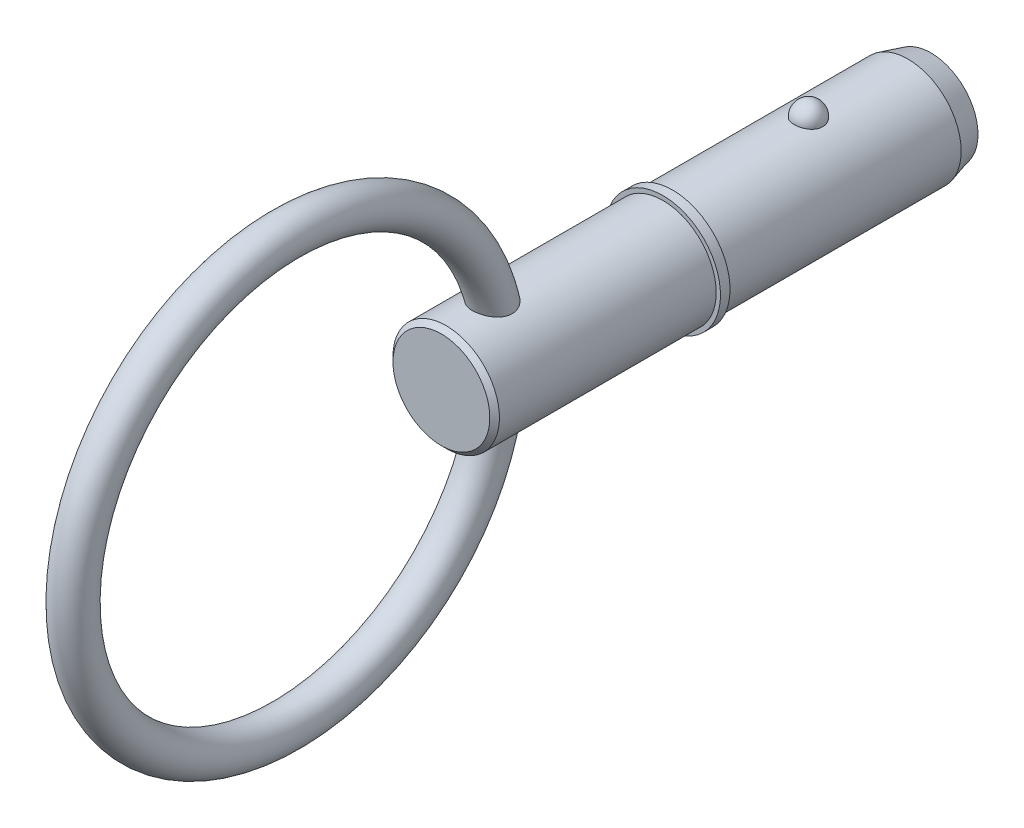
ISO-10303-21;
HEADER;
FILE_DESCRIPTION(('STEP AP214'),'2;1');
FILE_NAME('part.step','',(''),(''),'','','');
FILE_SCHEMA(('AUTOMOTIVE_DESIGN { 1 0 10303 214 1 1 1 1 }'));
ENDSEC;
DATA;
#1=APPLICATION_CONTEXT('core data for automotive mechanical design processes');
#2=APPLICATION_PROTOCOL_DEFINITION('international standard','automotive_design',2000,#1);
#3=PRODUCT_CONTEXT('',#1,'mechanical');
#4=PRODUCT('Part','Part','',(#3));
#5=PRODUCT_RELATED_PRODUCT_CATEGORY('part','',(#4));
#6=PRODUCT_DEFINITION_FORMATION('','',#4);
#7=PRODUCT_DEFINITION_CONTEXT('part definition',#1,'design');
#8=PRODUCT_DEFINITION('design','',#6,#7);
#9=PRODUCT_DEFINITION_SHAPE('','',#8);
#10=(LENGTH_UNIT() NAMED_UNIT(*) SI_UNIT(.MILLI.,.METRE.));
#11=(NAMED_UNIT(*) PLANE_ANGLE_UNIT() SI_UNIT($,.RADIAN.));
#12=(NAMED_UNIT(*) SI_UNIT($,.STERADIAN.) SOLID_ANGLE_UNIT());
#13=UNCERTAINTY_MEASURE_WITH_UNIT(LENGTH_MEASURE(1.E-05),#10,'distance_accuracy_value','');
#14=(GEOMETRIC_REPRESENTATION_CONTEXT(3) GLOBAL_UNCERTAINTY_ASSIGNED_CONTEXT((#13)) GLOBAL_UNIT_ASSIGNED_CONTEXT((#10,
#11,#12)) REPRESENTATION_CONTEXT('',''));
#15=CARTESIAN_POINT('',(0.,0.,0.));
#16=DIRECTION('',(0.,0.,1.));
#17=DIRECTION('',(1.,0.,0.));
#18=AXIS2_PLACEMENT_3D('',#15,#16,#17);
#19=CARTESIAN_POINT('',(0.,0.,12.7));
#20=DIRECTION('',(0.,0.,-1.));
#21=DIRECTION('',(-1.,0.,0.));
#22=AXIS2_PLACEMENT_3D('',#19,#20,#21);
#23=CYLINDRICAL_SURFACE('',#22,5.555);
#24=CARTESIAN_POINT('',(1.47653932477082,5.35517101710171,-1.49));
#25=CARTESIAN_POINT('',(1.47653767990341,5.35517235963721,-1.40667872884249));
#26=CARTESIAN_POINT('',(1.4697233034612,5.35706459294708,-1.32333626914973));
#27=CARTESIAN_POINT('',(1.4426291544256,5.36442332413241,-1.15900769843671));
#28=CARTESIAN_POINT('',(1.42234344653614,5.36989139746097,-1.07802264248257));
#29=CARTESIAN_POINT('',(1.36882802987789,5.38378061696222,-0.920757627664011));
#30=CARTESIAN_POINT('',(1.33560404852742,5.39220045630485,-0.844475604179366));
#31=CARTESIAN_POINT('',(1.25704906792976,5.41105136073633,-0.698703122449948));
#32=CARTESIAN_POINT('',(1.21171855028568,5.42148234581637,-0.629212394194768));
#33=CARTESIAN_POINT('',(1.10986325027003,5.44324765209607,-0.498626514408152));
#34=CARTESIAN_POINT('',(1.05328868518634,5.45458585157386,-0.437570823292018));
#35=CARTESIAN_POINT('',(0.930545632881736,5.4768596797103,-0.325918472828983));
#36=CARTESIAN_POINT('',(0.864377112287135,5.48779530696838,-0.275321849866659));
#37=CARTESIAN_POINT('',(0.724412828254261,5.50801510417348,-0.186125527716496));
#38=CARTESIAN_POINT('',(0.650637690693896,5.51730356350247,-0.147494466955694));
#39=CARTESIAN_POINT('',(0.497383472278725,5.53322345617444,-0.0831582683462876));
#40=CARTESIAN_POINT('',(0.417904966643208,5.53985515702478,-0.0574518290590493));
#41=CARTESIAN_POINT('',(0.256903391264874,5.54963245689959,-0.0200294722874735));
#42=CARTESIAN_POINT('',(0.17543580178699,5.55283384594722,-0.00808940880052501));
#43=CARTESIAN_POINT('',(0.0115885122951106,5.55559187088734,0.00221439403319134));
#44=CARTESIAN_POINT('',(-0.0707911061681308,5.55514883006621,0.000579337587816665));
#45=CARTESIAN_POINT('',(-0.232980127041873,5.55069756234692,-0.0161051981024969));
#46=CARTESIAN_POINT('',(-0.312809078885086,5.54673626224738,-0.0309781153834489));
#47=CARTESIAN_POINT('',(-0.468771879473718,5.5357377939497,-0.073474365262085));
#48=CARTESIAN_POINT('',(-0.544905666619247,5.52870057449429,-0.101097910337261));
#49=CARTESIAN_POINT('',(-0.691800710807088,5.51225307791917,-0.168516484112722));
#50=CARTESIAN_POINT('',(-0.762530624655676,5.50283015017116,-0.208376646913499));
#51=CARTESIAN_POINT('',(-0.896294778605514,5.48263289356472,-0.299136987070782));
#52=CARTESIAN_POINT('',(-0.959328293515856,5.47185843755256,-0.350038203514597));
#53=CARTESIAN_POINT('',(-1.07712789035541,5.44990641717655,-0.462517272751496));
#54=CARTESIAN_POINT('',(-1.13172901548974,5.43872509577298,-0.524267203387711));
#55=CARTESIAN_POINT('',(-1.2299173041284,5.41736658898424,-0.656133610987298));
#56=CARTESIAN_POINT('',(-1.2735037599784,5.40718946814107,-0.726250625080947));
#57=CARTESIAN_POINT('',(-1.34896420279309,5.38886361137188,-0.873713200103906));
#58=CARTESIAN_POINT('',(-1.38071142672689,5.38073711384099,-0.951126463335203));
#59=CARTESIAN_POINT('',(-1.4310375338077,5.36757288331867,-1.11037033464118));
#60=CARTESIAN_POINT('',(-1.44961676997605,5.3625350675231,-1.19220082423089));
#61=CARTESIAN_POINT('',(-1.47308754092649,5.35613553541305,-1.35761209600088));
#62=CARTESIAN_POINT('',(-1.47803294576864,5.35475935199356,-1.44118467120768));
#63=CARTESIAN_POINT('',(-1.47426441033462,5.35579807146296,-1.6079958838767));
#64=CARTESIAN_POINT('',(-1.46555080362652,5.35821288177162,-1.69123452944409));
#65=CARTESIAN_POINT('',(-1.43475662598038,5.36653964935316,-1.8546288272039));
#66=CARTESIAN_POINT('',(-1.41273621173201,5.37243586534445,-1.93479663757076));
#67=CARTESIAN_POINT('',(-1.35593151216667,5.38705199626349,-2.0902011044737));
#68=CARTESIAN_POINT('',(-1.32114675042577,5.39577201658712,-2.16543757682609));
#69=CARTESIAN_POINT('',(-1.23947506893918,5.41511674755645,-2.30926926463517));
#70=CARTESIAN_POINT('',(-1.1925277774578,5.42575087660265,-2.37782893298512));
#71=CARTESIAN_POINT('',(-1.08780725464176,5.44771095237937,-2.50598876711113));
#72=CARTESIAN_POINT('',(-1.03003365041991,5.45903692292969,-2.56558862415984));
#73=CARTESIAN_POINT('',(-0.904953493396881,5.48116073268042,-2.67436535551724));
#74=CARTESIAN_POINT('',(-0.837616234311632,5.49195671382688,-2.7235073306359));
#75=CARTESIAN_POINT('',(-0.695379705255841,5.51177099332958,-2.8097317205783));
#76=CARTESIAN_POINT('',(-0.620480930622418,5.52078940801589,-2.84681492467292));
#77=CARTESIAN_POINT('',(-0.466144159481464,5.53594369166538,-2.90749751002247));
#78=CARTESIAN_POINT('',(-0.386768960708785,5.54211181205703,-2.93124844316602));
#79=CARTESIAN_POINT('',(-0.224991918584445,5.5510324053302,-2.96523308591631));
#80=CARTESIAN_POINT('',(-0.142590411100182,5.55378525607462,-2.97546829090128));
#81=CARTESIAN_POINT('',(0.0213711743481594,5.55555351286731,-2.98206550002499));
#82=CARTESIAN_POINT('',(0.102921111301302,5.55463281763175,-2.97866468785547));
#83=CARTESIAN_POINT('',(0.2642564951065,5.54929804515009,-2.95862186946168));
#84=CARTESIAN_POINT('',(0.344041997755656,5.54488407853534,-2.94198028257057));
#85=CARTESIAN_POINT('',(0.499344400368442,5.53305794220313,-2.89600357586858));
#86=CARTESIAN_POINT('',(0.574874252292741,5.52565550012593,-2.86670961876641));
#87=CARTESIAN_POINT('',(0.71989857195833,5.50863937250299,-2.79624249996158));
#88=CARTESIAN_POINT('',(0.789392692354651,5.49902555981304,-2.75506865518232));
#89=CARTESIAN_POINT('',(0.921480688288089,5.47845199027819,-2.66127110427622));
#90=CARTESIAN_POINT('',(0.983960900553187,5.46747485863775,-2.60849118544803));
#91=CARTESIAN_POINT('',(1.09925057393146,5.44546837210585,-2.49325304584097));
#92=CARTESIAN_POINT('',(1.15205830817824,5.43443900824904,-2.43079310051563));
#93=CARTESIAN_POINT('',(1.24742943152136,5.41335152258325,-2.29680711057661));
#94=CARTESIAN_POINT('',(1.28981661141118,5.40331162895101,-2.22515272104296));
#95=CARTESIAN_POINT('',(1.36214937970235,5.38553336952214,-2.07558035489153));
#96=CARTESIAN_POINT('',(1.39210034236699,5.37779400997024,-1.99766510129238));
#97=CARTESIAN_POINT('',(1.43569518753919,5.36630594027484,-1.84848338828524));
#98=CARTESIAN_POINT('',(1.45098536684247,5.36216169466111,-1.77772322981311));
#99=CARTESIAN_POINT('',(1.47140805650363,5.35659367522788,-1.63464735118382));
#100=CARTESIAN_POINT('',(1.47654075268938,5.35516985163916,-1.56233165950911));
#101=CARTESIAN_POINT('',(1.47653932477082,5.35517101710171,-1.49));
#102=B_SPLINE_CURVE_WITH_KNOTS('',3,(#24,#25,#26,#27,#28,#29,#30,#31,#32,#33,#34,#35,#36,#37,
#38,#39,#40,#41,#42,#43,#44,#45,#46,#47,#48,#49,#50,#51,#52,#53,#54,#55,#56,#57,#58,#59,#60,#61,
#62,#63,#64,#65,#66,#67,#68,#69,#70,#71,#72,#73,#74,#75,#76,#77,#78,#79,#80,#81,#82,#83,#84,#85,
#86,#87,#88,#89,#90,#91,#92,#93,#94,#95,#96,#97,#98,#99,#100,#101),.UNSPECIFIED.,.T.,.F.,(4,2,2,
2,2,2,2,2,2,2,2,2,2,2,2,2,2,2,2,2,2,2,2,2,2,2,2,2,2,2,2,2,2,2,2,2,2,2,4),(0.,0.249703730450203,
0.4995175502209,0.749220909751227,0.998914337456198,1.24973894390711,1.50056442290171,
1.75072681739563,2.00086401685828,2.24686822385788,2.49285060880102,2.73560052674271,
2.97835449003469,3.22242369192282,3.46651587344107,3.71490232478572,3.96330473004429,
4.21429522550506,4.46527899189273,4.71526963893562,4.9652541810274,5.21411697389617,
5.46298905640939,5.71312097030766,5.96326150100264,6.21422412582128,6.46517032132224,
6.71320296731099,6.96120816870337,7.20491846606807,7.44862104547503,7.69153667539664,
7.93446627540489,8.18089104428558,8.42735976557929,8.67774679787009,8.92802551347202,
9.14479867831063,9.36156787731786),.UNSPECIFIED.);
#103=CARTESIAN_POINT('',(1.47653932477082,5.35517101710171,-1.49));
#104=VERTEX_POINT('',#103);
#105=EDGE_CURVE('E103',#104,#104,#102,.T.);
#106=ORIENTED_EDGE('',*,*,#105,.T.);
#107=EDGE_LOOP('',(#106));
#108=FACE_BOUND('',#107,.T.);
#109=CARTESIAN_POINT('',(0.,0.,-11.87));
#110=DIRECTION('',(0.,0.,-1.));
#111=DIRECTION('',(-1.,0.,0.));
#112=AXIS2_PLACEMENT_3D('',#109,#110,#111);
#113=CIRCLE('',#112,5.555);
#114=CARTESIAN_POINT('',(5.555,0.,-11.87));
#115=VERTEX_POINT('',#114);
#116=EDGE_CURVE('E111',#115,#115,#113,.F.);
#117=ORIENTED_EDGE('',*,*,#116,.T.);
#118=EDGE_LOOP('',(#117));
#119=FACE_BOUND('',#118,.T.);
#120=CARTESIAN_POINT('',(0.,0.,12.7));
#121=DIRECTION('',(0.,0.,1.));
#122=DIRECTION('',(1.,0.,0.));
#123=AXIS2_PLACEMENT_3D('',#120,#121,#122);
#124=CIRCLE('',#123,5.555);
#125=CARTESIAN_POINT('',(5.555,0.,12.7));
#126=VERTEX_POINT('',#125);
#127=EDGE_CURVE('E109',#126,#126,#124,.T.);
#128=ORIENTED_EDGE('',*,*,#127,.F.);
#129=EDGE_LOOP('',(#128));
#130=FACE_BOUND('',#129,.T.);
#131=ADVANCED_FACE('F39',(#108,#119,#130),#23,.T.);
#132=CARTESIAN_POINT('',(0.,0.,-14.27));
#133=DIRECTION('',(0.,0.,-1.));
#134=DIRECTION('',(-1.,0.,0.));
#135=AXIS2_PLACEMENT_3D('',#132,#133,#134);
#136=PLANE('',#135);
#137=CARTESIAN_POINT('',(0.,0.,-14.27));
#138=DIRECTION('',(0.,0.,-1.));
#139=DIRECTION('',(-1.,0.,0.));
#140=AXIS2_PLACEMENT_3D('',#137,#138,#139);
#141=CIRCLE('',#140,4.9119219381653);
#142=CARTESIAN_POINT('',(4.9119219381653,0.,-14.27));
#143=VERTEX_POINT('',#142);
#144=EDGE_CURVE('E143',#143,#143,#141,.T.);
#145=ORIENTED_EDGE('',*,*,#144,.T.);
#146=EDGE_LOOP('',(#145));
#147=FACE_BOUND('',#146,.T.);
#148=ADVANCED_FACE('F89',(#147),#136,.T.);
#149=CARTESIAN_POINT('',(0.,0.,-14.27));
#150=DIRECTION('',(0.,0.,1.));
#151=DIRECTION('',(1.,0.,0.));
#152=AXIS2_PLACEMENT_3D('',#149,#150,#151);
#153=CONICAL_SURFACE('',#152,4.9119219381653,0.261799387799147);
#154=CARTESIAN_POINT('',(5.555,0.,-11.87));
#155=CARTESIAN_POINT('',(5.54830127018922,0.,-11.895));
#156=CARTESIAN_POINT('',(5.54160254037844,0.,-11.92));
#157=CARTESIAN_POINT('',(5.52820508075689,0.,-11.97));
#158=CARTESIAN_POINT('',(5.52150635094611,0.,-11.995));
#159=CARTESIAN_POINT('',(5.50810889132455,0.,-12.045));
#160=CARTESIAN_POINT('',(5.50141016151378,0.,-12.07));
#161=CARTESIAN_POINT('',(5.48801270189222,0.,-12.12));
#162=CARTESIAN_POINT('',(5.48131397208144,0.,-12.145));
#163=CARTESIAN_POINT('',(5.46791651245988,0.,-12.195));
#164=CARTESIAN_POINT('',(5.46121778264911,0.,-12.22));
#165=CARTESIAN_POINT('',(5.44782032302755,0.,-12.27));
#166=CARTESIAN_POINT('',(5.44112159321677,0.,-12.295));
#167=CARTESIAN_POINT('',(5.42772413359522,0.,-12.345));
#168=CARTESIAN_POINT('',(5.42102540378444,0.,-12.37));
#169=CARTESIAN_POINT('',(5.40762794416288,0.,-12.42));
#170=CARTESIAN_POINT('',(5.4009292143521,0.,-12.445));
#171=CARTESIAN_POINT('',(5.38753175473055,0.,-12.495));
#172=CARTESIAN_POINT('',(5.38083302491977,0.,-12.52));
#173=CARTESIAN_POINT('',(5.36743556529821,0.,-12.57));
#174=CARTESIAN_POINT('',(5.36073683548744,0.,-12.595));
#175=CARTESIAN_POINT('',(5.34733937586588,0.,-12.645));
#176=CARTESIAN_POINT('',(5.3406406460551,0.,-12.67));
#177=CARTESIAN_POINT('',(5.32724318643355,0.,-12.72));
#178=CARTESIAN_POINT('',(5.32054445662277,0.,-12.745));
#179=CARTESIAN_POINT('',(5.30714699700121,0.,-12.795));
#180=CARTESIAN_POINT('',(5.30044826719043,0.,-12.82));
#181=CARTESIAN_POINT('',(5.28705080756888,0.,-12.87));
#182=CARTESIAN_POINT('',(5.2803520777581,0.,-12.895));
#183=CARTESIAN_POINT('',(5.26695461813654,0.,-12.945));
#184=CARTESIAN_POINT('',(5.26025588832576,0.,-12.97));
#185=CARTESIAN_POINT('',(5.24685842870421,0.,-13.02));
#186=CARTESIAN_POINT('',(5.24015969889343,0.,-13.045));
#187=CARTESIAN_POINT('',(5.22676223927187,0.,-13.095));
#188=CARTESIAN_POINT('',(5.2200635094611,0.,-13.12));
#189=CARTESIAN_POINT('',(5.20666604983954,0.,-13.17));
#190=CARTESIAN_POINT('',(5.19996732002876,0.,-13.195));
#191=CARTESIAN_POINT('',(5.1865698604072,0.,-13.245));
#192=CARTESIAN_POINT('',(5.17987113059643,0.,-13.27));
#193=CARTESIAN_POINT('',(5.16647367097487,0.,-13.32));
#194=CARTESIAN_POINT('',(5.15977494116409,0.,-13.345));
#195=CARTESIAN_POINT('',(5.14637748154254,0.,-13.395));
#196=CARTESIAN_POINT('',(5.13967875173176,0.,-13.42));
#197=CARTESIAN_POINT('',(5.1262812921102,0.,-13.47));
#198=CARTESIAN_POINT('',(5.11958256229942,0.,-13.495));
#199=CARTESIAN_POINT('',(5.10618510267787,0.,-13.545));
#200=CARTESIAN_POINT('',(5.09948637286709,0.,-13.57));
#201=CARTESIAN_POINT('',(5.08608891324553,0.,-13.62));
#202=CARTESIAN_POINT('',(5.07939018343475,0.,-13.645));
#203=CARTESIAN_POINT('',(5.0659927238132,0.,-13.695));
#204=CARTESIAN_POINT('',(5.05929399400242,0.,-13.72));
#205=CARTESIAN_POINT('',(5.04589653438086,0.,-13.77));
#206=CARTESIAN_POINT('',(5.03919780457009,0.,-13.795));
#207=CARTESIAN_POINT('',(5.02580034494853,0.,-13.845));
#208=CARTESIAN_POINT('',(5.01910161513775,0.,-13.87));
#209=CARTESIAN_POINT('',(5.0057041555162,0.,-13.92));
#210=CARTESIAN_POINT('',(4.99900542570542,0.,-13.945));
#211=CARTESIAN_POINT('',(4.98560796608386,0.,-13.995));
#212=CARTESIAN_POINT('',(4.97890923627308,0.,-14.02));
#213=CARTESIAN_POINT('',(4.96551177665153,0.,-14.07));
#214=CARTESIAN_POINT('',(4.95881304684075,0.,-14.095));
#215=CARTESIAN_POINT('',(4.94541558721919,0.,-14.145));
#216=CARTESIAN_POINT('',(4.93871685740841,0.,-14.17));
#217=CARTESIAN_POINT('',(4.92531939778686,0.,-14.22));
#218=CARTESIAN_POINT('',(4.91862066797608,0.,-14.245));
#219=CARTESIAN_POINT('',(4.9119219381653,0.,-14.27));
#220=B_SPLINE_CURVE_WITH_KNOTS('',3,(#154,#155,#156,#157,#158,#159,#160,#161,#162,#163,#164,
#165,#166,#167,#168,#169,#170,#171,#172,#173,#174,#175,#176,#177,#178,#179,#180,#181,#182,#183,
#184,#185,#186,#187,#188,#189,#190,#191,#192,#193,#194,#195,#196,#197,#198,#199,#200,#201,#202,
#203,#204,#205,#206,#207,#208,#209,#210,#211,#212,#213,#214,#215,#216,#217,#218,#219),
.UNSPECIFIED.,.F.,.F.,(4,2,2,2,2,2,2,2,2,2,2,2,2,2,2,2,2,2,2,2,2,2,2,2,2,2,2,2,2,2,2,2,4),(0.,
0.0776457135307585,0.155291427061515,0.232937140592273,0.31058285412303,0.388228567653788,
0.465874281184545,0.543519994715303,0.62116570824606,0.698811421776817,0.776457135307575,
0.854102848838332,0.93174856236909,1.00939427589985,1.08703998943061,1.16468570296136,
1.24233141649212,1.31997713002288,1.39762284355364,1.47526855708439,1.55291427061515,
1.63055998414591,1.70820569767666,1.78585141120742,1.86349712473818,1.94114283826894,
2.0187885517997,2.09643426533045,2.17407997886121,2.25172569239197,2.32937140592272,
2.40701711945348,2.48466283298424),.UNSPECIFIED.);
#221=EDGE_CURVE('BSEAM95',#115,#143,#220,.T.);
#222=ORIENTED_EDGE('',*,*,#116,.F.);
#223=ORIENTED_EDGE('',*,*,#144,.F.);
#224=ORIENTED_EDGE('',*,*,#221,.T.);
#225=ORIENTED_EDGE('',*,*,#221,.F.);
#226=EDGE_LOOP('',(#222,#224,#223,#225));
#227=FACE_BOUND('',#226,.T.);
#228=ADVANCED_FACE('F95',(#227),#153,.T.);
#229=CARTESIAN_POINT('',(0.,5.555,-1.49));
#230=DIRECTION('',(0.,1.,0.));
#231=DIRECTION('',(0.,0.,-1.));
#232=AXIS2_PLACEMENT_3D('',#229,#230,#231);
#233=SPHERICAL_SURFACE('',#232,1.49);
#234=ORIENTED_EDGE('',*,*,#105,.F.);
#235=EDGE_LOOP('',(#234));
#236=FACE_BOUND('',#235,.T.);
#237=ADVANCED_FACE('F114',(#236),#233,.T.);
#238=CARTESIAN_POINT('',(0.,0.,12.7));
#239=DIRECTION('',(0.,0.,-1.));
#240=DIRECTION('',(-1.,0.,0.));
#241=AXIS2_PLACEMENT_3D('',#238,#239,#240);
#242=PLANE('',#241);
#243=ORIENTED_EDGE('',*,*,#127,.T.);
#244=EDGE_LOOP('',(#243));
#245=FACE_BOUND('',#244,.T.);
#246=CARTESIAN_POINT('',(0.,0.,12.7));
#247=DIRECTION('',(0.,0.,-1.));
#248=DIRECTION('',(-1.,0.,0.));
#249=AXIS2_PLACEMENT_3D('',#246,#247,#248);
#250=CIRCLE('',#249,6.);
#251=CARTESIAN_POINT('',(-6.,0.,12.7));
#252=VERTEX_POINT('',#251);
#253=EDGE_CURVE('E110',#252,#252,#250,.T.);
#254=ORIENTED_EDGE('',*,*,#253,.T.);
#255=EDGE_LOOP('',(#254));
#256=FACE_BOUND('',#255,.T.);
#257=ADVANCED_FACE('F118',(#245,#256),#242,.T.);
#258=CARTESIAN_POINT('',(0.,0.,33.7287874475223));
#259=DIRECTION('',(0.,0.,-1.));
#260=DIRECTION('',(-1.,0.,0.));
#261=AXIS2_PLACEMENT_3D('',#258,#259,#260);
#262=CYLINDRICAL_SURFACE('',#261,6.);
#263=CARTESIAN_POINT('',(0.,0.,13.7));
#264=DIRECTION('',(0.,0.,-1.));
#265=DIRECTION('',(-1.,0.,0.));
#266=AXIS2_PLACEMENT_3D('',#263,#264,#265);
#267=CIRCLE('',#266,6.);
#268=CARTESIAN_POINT('',(-6.,0.,13.7));
#269=VERTEX_POINT('',#268);
#270=EDGE_CURVE('E135',#269,#269,#267,.T.);
#271=ORIENTED_EDGE('',*,*,#270,.T.);
#272=EDGE_LOOP('',(#271));
#273=FACE_BOUND('',#272,.T.);
#274=ORIENTED_EDGE('',*,*,#253,.F.);
#275=EDGE_LOOP('',(#274));
#276=FACE_BOUND('',#275,.T.);
#277=ADVANCED_FACE('F122',(#273,#276),#262,.T.);
#278=CARTESIAN_POINT('',(0.,6.,13.7));
#279=DIRECTION('',(0.,0.,1.));
#280=DIRECTION('',(1.,0.,0.));
#281=AXIS2_PLACEMENT_3D('',#278,#279,#280);
#282=PLANE('',#281);
#283=CARTESIAN_POINT('',(0.,0.,13.7));
#284=DIRECTION('',(0.,0.,1.));
#285=DIRECTION('',(1.,0.,0.));
#286=AXIS2_PLACEMENT_3D('',#283,#284,#285);
#287=CIRCLE('',#286,5.555);
#288=CARTESIAN_POINT('',(5.555,0.,13.7));
#289=VERTEX_POINT('',#288);
#290=EDGE_CURVE('E113',#289,#289,#287,.T.);
#291=ORIENTED_EDGE('',*,*,#290,.F.);
#292=EDGE_LOOP('',(#291));
#293=FACE_BOUND('',#292,.T.);
#294=ORIENTED_EDGE('',*,*,#270,.F.);
#295=EDGE_LOOP('',(#294));
#296=FACE_BOUND('',#295,.T.);
#297=ADVANCED_FACE('F86',(#293,#296),#282,.T.);
#298=CARTESIAN_POINT('',(0.,0.,36.83));
#299=DIRECTION('',(0.,0.,-1.));
#300=DIRECTION('',(-1.,0.,0.));
#301=AXIS2_PLACEMENT_3D('',#298,#299,#300);
#302=CYLINDRICAL_SURFACE('',#301,5.555);
#303=CARTESIAN_POINT('',(-1.10556570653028,-5.44387265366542,29.7918269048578));
#304=CARTESIAN_POINT('',(-1.01228489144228,-5.46281185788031,29.7327206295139));
#305=CARTESIAN_POINT('',(-0.913680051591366,-5.48032092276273,29.6812596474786));
#306=CARTESIAN_POINT('',(-0.708593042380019,-5.51059942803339,29.5948655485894));
#307=CARTESIAN_POINT('',(-0.602092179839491,-5.52335716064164,29.5599732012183));
#308=CARTESIAN_POINT('',(-0.384392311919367,-5.54275997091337,29.5076350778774));
#309=CARTESIAN_POINT('',(-0.273196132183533,-5.54940867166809,29.4901789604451));
#310=CARTESIAN_POINT('',(-0.0493180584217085,-5.55590918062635,29.4731070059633));
#311=CARTESIAN_POINT('',(0.063362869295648,-5.55576521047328,29.4734800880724));
#312=CARTESIAN_POINT('',(0.286346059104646,-5.54872955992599,29.4919679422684));
#313=CARTESIAN_POINT('',(0.396658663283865,-5.54187921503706,29.5099740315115));
#314=CARTESIAN_POINT('',(0.612520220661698,-5.52219137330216,29.56315855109));
#315=CARTESIAN_POINT('',(0.718068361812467,-5.50935286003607,29.5983398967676));
#316=CARTESIAN_POINT('',(0.921837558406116,-5.47895041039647,29.6852597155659));
#317=CARTESIAN_POINT('',(1.02003071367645,-5.46136954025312,29.7370576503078));
#318=CARTESIAN_POINT('',(1.20597835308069,-5.42334376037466,29.8560715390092));
#319=CARTESIAN_POINT('',(1.29373197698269,-5.40289861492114,29.923288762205));
#320=CARTESIAN_POINT('',(1.4567614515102,-5.36124957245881,30.0720711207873));
#321=CARTESIAN_POINT('',(1.53197150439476,-5.34004234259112,30.1537075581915));
#322=CARTESIAN_POINT('',(1.66713264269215,-5.29940466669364,30.3291453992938));
#323=CARTESIAN_POINT('',(1.72708783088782,-5.27997374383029,30.4229435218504));
#324=CARTESIAN_POINT('',(1.82862428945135,-5.24566221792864,30.6176424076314));
#325=CARTESIAN_POINT('',(1.87063678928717,-5.23067782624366,30.718299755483));
#326=CARTESIAN_POINT('',(1.93737592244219,-5.20633032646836,30.9258105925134));
#327=CARTESIAN_POINT('',(1.96210708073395,-5.19696574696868,31.0326624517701));
#328=CARTESIAN_POINT('',(1.99354605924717,-5.18498534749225,31.2461199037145));
#329=CARTESIAN_POINT('',(2.00075888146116,-5.18218052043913,31.35264165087));
#330=CARTESIAN_POINT('',(1.99911392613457,-5.18281429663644,31.5655234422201));
#331=CARTESIAN_POINT('',(1.99025240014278,-5.18625435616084,31.6718834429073));
#332=CARTESIAN_POINT('',(1.95669906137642,-5.19900800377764,31.8864137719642));
#333=CARTESIAN_POINT('',(1.93133897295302,-5.20856925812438,31.9944633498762));
#334=CARTESIAN_POINT('',(1.86545555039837,-5.23252509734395,32.2052626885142));
#335=CARTESIAN_POINT('',(1.82492543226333,-5.24692184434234,32.3080100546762));
#336=CARTESIAN_POINT('',(1.72463327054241,-5.28079222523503,32.5172641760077));
#337=CARTESIAN_POINT('',(1.66323898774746,-5.30065143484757,32.6229280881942));
#338=CARTESIAN_POINT('',(1.52453457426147,-5.34219591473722,32.8229747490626));
#339=CARTESIAN_POINT('',(1.44720966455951,-5.36388286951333,32.917346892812));
#340=CARTESIAN_POINT('',(1.27294559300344,-5.4079730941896,33.0971131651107));
#341=CARTESIAN_POINT('',(1.17513186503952,-5.43034544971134,33.181674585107));
#342=CARTESIAN_POINT('',(0.964857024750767,-5.4716061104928,33.3310984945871));
#343=CARTESIAN_POINT('',(0.852422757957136,-5.49050065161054,33.3959963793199));
#344=CARTESIAN_POINT('',(0.645365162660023,-5.51811399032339,33.4886389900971));
#345=CARTESIAN_POINT('',(0.553250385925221,-5.52819450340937,33.5216075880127));
#346=CARTESIAN_POINT('',(0.364552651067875,-5.54383049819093,33.5722712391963));
#347=CARTESIAN_POINT('',(0.267973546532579,-5.54938980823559,33.5899792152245));
#348=CARTESIAN_POINT('',(0.0727820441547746,-5.55538329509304,33.6090574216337));
#349=CARTESIAN_POINT('',(-0.0258350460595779,-5.55580391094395,33.6103844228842));
#350=CARTESIAN_POINT('',(-0.221785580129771,-5.55143625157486,33.5964996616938));
#351=CARTESIAN_POINT('',(-0.319118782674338,-5.54664701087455,33.5812848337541));
#352=CARTESIAN_POINT('',(-0.506008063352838,-5.53267054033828,33.5361739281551));
#353=CARTESIAN_POINT('',(-0.595719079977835,-5.5236568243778,33.5068559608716));
#354=CARTESIAN_POINT('',(-0.769362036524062,-5.50216076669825,33.4353157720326));
#355=CARTESIAN_POINT('',(-0.853292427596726,-5.48967749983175,33.3930901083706));
#356=CARTESIAN_POINT('',(-1.02151462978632,-5.46099631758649,33.2929584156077));
#357=CARTESIAN_POINT('',(-1.1051114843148,-5.44456066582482,33.233957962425));
#358=CARTESIAN_POINT('',(-1.26267159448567,-5.41019420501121,33.1046365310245));
#359=CARTESIAN_POINT('',(-1.33662934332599,-5.3922625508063,33.0343091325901));
#360=CARTESIAN_POINT('',(-1.48493551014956,-5.3534806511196,32.8723181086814));
#361=CARTESIAN_POINT('',(-1.55751884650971,-5.33261459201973,32.7790383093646));
#362=CARTESIAN_POINT('',(-1.68764911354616,-5.29287292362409,32.5820721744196));
#363=CARTESIAN_POINT('',(-1.74518451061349,-5.27399884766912,32.4783779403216));
#364=CARTESIAN_POINT('',(-1.84836300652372,-5.23878102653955,32.2530447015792));
#365=CARTESIAN_POINT('',(-1.89246300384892,-5.22281969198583,32.1306308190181));
#366=CARTESIAN_POINT('',(-1.9591443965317,-5.19817931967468,31.8793563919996));
#367=CARTESIAN_POINT('',(-1.98173864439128,-5.1894959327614,31.7504997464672));
#368=CARTESIAN_POINT('',(-2.00273730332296,-5.1814274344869,31.4985166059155));
#369=CARTESIAN_POINT('',(-2.00255101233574,-5.18150060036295,31.3755284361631));
#370=CARTESIAN_POINT('',(-1.98037843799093,-5.19001679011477,31.1318570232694));
#371=CARTESIAN_POINT('',(-1.9584117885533,-5.19845227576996,31.0111718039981));
#372=CARTESIAN_POINT('',(-1.89636207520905,-5.22137691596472,30.7893859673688));
#373=CARTESIAN_POINT('',(-1.85849749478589,-5.23511192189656,30.6875795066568));
#374=CARTESIAN_POINT('',(-1.76641220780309,-5.26689405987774,30.4923112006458));
#375=CARTESIAN_POINT('',(-1.712182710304,-5.28494350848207,30.3988538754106));
#376=CARTESIAN_POINT('',(-1.59009056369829,-5.32293530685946,30.2244851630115));
#377=CARTESIAN_POINT('',(-1.52250077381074,-5.3428361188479,30.1433724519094));
#378=CARTESIAN_POINT('',(-1.3749952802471,-5.38267630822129,29.9935527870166));
#379=CARTESIAN_POINT('',(-1.29510747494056,-5.40261549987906,29.9248184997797));
#380=CARTESIAN_POINT('',(-1.17610576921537,-5.42918364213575,29.8381340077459));
#381=CARTESIAN_POINT('',(-1.1412247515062,-5.43663264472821,29.8144218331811));
#382=CARTESIAN_POINT('',(-1.10556570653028,-5.44387265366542,29.7918269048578));
#383=B_SPLINE_CURVE_WITH_KNOTS('',3,(#303,#304,#305,#306,#307,#308,#309,#310,#311,#312,#313,
#314,#315,#316,#317,#318,#319,#320,#321,#322,#323,#324,#325,#326,#327,#328,#329,#330,#331,#332,
#333,#334,#335,#336,#337,#338,#339,#340,#341,#342,#343,#344,#345,#346,#347,#348,#349,#350,#351,
#352,#353,#354,#355,#356,#357,#358,#359,#360,#361,#362,#363,#364,#365,#366,#367,#368,#369,#370,
#371,#372,#373,#374,#375,#376,#377,#378,#379,#380,#381,#382),.UNSPECIFIED.,.T.,.F.,(4,2,2,2,2,2,
2,2,2,2,2,2,2,2,2,2,2,2,2,2,2,2,2,2,2,2,2,2,2,2,2,2,2,2,2,2,2,2,2,4),(0.,0.33600790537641,
0.672838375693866,1.00946895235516,1.3458903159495,1.68025107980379,2.01466861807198,
2.35029645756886,2.68595193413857,3.02331620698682,3.36058964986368,3.68922559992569,
4.01777546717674,4.33673549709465,4.65576991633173,4.98860663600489,5.32159237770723,
5.69143772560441,6.06162774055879,6.45318675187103,6.84403669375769,7.13784774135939,
7.43140974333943,7.72574628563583,8.02013738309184,8.30337410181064,8.58668641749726,
8.89639605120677,9.20628185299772,9.56486628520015,9.92372475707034,10.3149894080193,
10.7060200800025,11.07287301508,11.4393955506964,11.7662424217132,12.0932651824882,
12.4141944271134,12.734406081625,12.8628539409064),.UNSPECIFIED.);
#384=CARTESIAN_POINT('',(-1.10556570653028,-5.44387265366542,29.7918269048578));
#385=VERTEX_POINT('',#384);
#386=EDGE_CURVE('E10',#385,#385,#383,.T.);
#387=ORIENTED_EDGE('',*,*,#386,.F.);
#388=EDGE_LOOP('',(#387));
#389=FACE_BOUND('',#388,.T.);
#390=CARTESIAN_POINT('',(-1.10556570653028,5.44387265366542,29.7918269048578));
#391=CARTESIAN_POINT('',(-1.19738353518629,5.42522409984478,29.8500196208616));
#392=CARTESIAN_POINT('',(-1.28429924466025,5.40513601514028,29.9157939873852));
#393=CARTESIAN_POINT('',(-1.44581541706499,5.36419888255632,30.0610964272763));
#394=CARTESIAN_POINT('',(-1.52038725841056,5.34334819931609,30.1406556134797));
#395=CARTESIAN_POINT('',(-1.65499055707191,5.30320409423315,30.3117253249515));
#396=CARTESIAN_POINT('',(-1.71501315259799,5.28391162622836,30.4032430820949));
#397=CARTESIAN_POINT('',(-1.818626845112,5.24915480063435,30.5957286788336));
#398=CARTESIAN_POINT('',(-1.86223183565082,5.23368721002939,30.6966884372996));
#399=CARTESIAN_POINT('',(-1.93097818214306,5.20870993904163,30.9023384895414));
#400=CARTESIAN_POINT('',(-1.9565843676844,5.19905127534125,31.0068555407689));
#401=CARTESIAN_POINT('',(-1.99087306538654,5.18601876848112,31.2190021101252));
#402=CARTESIAN_POINT('',(-1.99955381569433,5.18264557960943,31.3266319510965));
#403=CARTESIAN_POINT('',(-2.00041152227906,5.18231352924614,31.5415950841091));
#404=CARTESIAN_POINT('',(-1.99263868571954,5.18533515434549,31.6489282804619));
#405=CARTESIAN_POINT('',(-1.96165402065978,5.19713416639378,31.860993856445));
#406=CARTESIAN_POINT('',(-1.93843757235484,5.20591327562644,31.9657254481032));
#407=CARTESIAN_POINT('',(-1.87519933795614,5.22904145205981,32.1789266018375));
#408=CARTESIAN_POINT('',(-1.8339426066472,5.2437923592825,32.2869848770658));
#409=CARTESIAN_POINT('',(-1.73605100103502,5.27700825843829,32.4953388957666));
#410=CARTESIAN_POINT('',(-1.67940322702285,5.29547636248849,32.5956280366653));
#411=CARTESIAN_POINT('',(-1.54513029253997,5.33629364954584,32.7964709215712));
#412=CARTESIAN_POINT('',(-1.46591925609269,5.35884672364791,32.8959287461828));
#413=CARTESIAN_POINT('',(-1.29147372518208,5.40353609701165,33.0797586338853));
#414=CARTESIAN_POINT('',(-1.19624935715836,5.4256726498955,33.1641401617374));
#415=CARTESIAN_POINT('',(-1.00908302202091,5.4632636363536,33.3012785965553));
#416=CARTESIAN_POINT('',(-0.919399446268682,5.47921232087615,33.3569791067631));
#417=CARTESIAN_POINT('',(-0.731673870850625,5.5074185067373,33.4531850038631));
#418=CARTESIAN_POINT('',(-0.633638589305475,5.51967893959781,33.493702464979));
#419=CARTESIAN_POINT('',(-0.430875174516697,5.53920484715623,33.5574420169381));
#420=CARTESIAN_POINT('',(-0.32610938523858,5.5464389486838,33.5805555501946));
#421=CARTESIAN_POINT('',(-0.113884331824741,5.55484501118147,33.6073650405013));
#422=CARTESIAN_POINT('',(-0.00642653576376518,5.55602020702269,33.6110713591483));
#423=CARTESIAN_POINT('',(0.195800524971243,5.55237120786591,33.5994716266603));
#424=CARTESIAN_POINT('',(0.290702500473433,5.54817250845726,33.586148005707));
#425=CARTESIAN_POINT('',(0.476860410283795,5.53528124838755,33.5446426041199));
#426=CARTESIAN_POINT('',(0.568115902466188,5.52658814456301,33.5164590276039));
#427=CARTESIAN_POINT('',(0.746220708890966,5.50539361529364,33.4461889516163));
#428=CARTESIAN_POINT('',(0.832980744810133,5.49283571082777,33.403895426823));
#429=CARTESIAN_POINT('',(0.99907604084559,5.46506864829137,33.3073533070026));
#430=CARTESIAN_POINT('',(1.07840848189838,5.44985848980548,33.2531001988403));
#431=CARTESIAN_POINT('',(1.23895859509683,5.4157763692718,33.1262545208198));
#432=CARTESIAN_POINT('',(1.31894875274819,5.39668813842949,33.0521682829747));
#433=CARTESIAN_POINT('',(1.46711056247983,5.35830946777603,32.8930172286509));
#434=CARTESIAN_POINT('',(1.53527331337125,5.33901888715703,32.8079442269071));
#435=CARTESIAN_POINT('',(1.66781491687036,5.29923347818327,32.6157794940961));
#436=CARTESIAN_POINT('',(1.73023469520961,5.27896539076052,32.5072812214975));
#437=CARTESIAN_POINT('',(1.83696481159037,5.24278292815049,32.2809779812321));
#438=CARTESIAN_POINT('',(1.88126919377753,5.22686998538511,32.163169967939));
#439=CARTESIAN_POINT('',(1.95069203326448,5.20136930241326,31.9184600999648));
#440=CARTESIAN_POINT('',(1.9753695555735,5.19192755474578,31.7914156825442));
#441=CARTESIAN_POINT('',(2.00184165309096,5.18178397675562,31.5346371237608));
#442=CARTESIAN_POINT('',(2.0036606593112,5.1810728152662,31.4049060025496));
#443=CARTESIAN_POINT('',(1.98420851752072,5.18854656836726,31.1612196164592));
#444=CARTESIAN_POINT('',(1.96534949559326,5.19580226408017,31.0470420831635));
#445=CARTESIAN_POINT('',(1.9082478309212,5.21704286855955,30.8243013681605));
#446=CARTESIAN_POINT('',(1.87001142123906,5.23102561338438,30.7157363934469));
#447=CARTESIAN_POINT('',(1.77872645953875,5.26272634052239,30.5156482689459));
#448=CARTESIAN_POINT('',(1.72700534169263,5.2800851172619,30.4234576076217));
#449=CARTESIAN_POINT('',(1.60923581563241,5.31715956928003,30.2492732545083));
#450=CARTESIAN_POINT('',(1.54318655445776,5.33687538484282,30.1672801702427));
#451=CARTESIAN_POINT('',(1.39729379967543,5.37693236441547,30.0140270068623));
#452=CARTESIAN_POINT('',(1.31723271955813,5.39727845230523,29.9429756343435));
#453=CARTESIAN_POINT('',(1.14625215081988,5.43615785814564,29.8147996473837));
#454=CARTESIAN_POINT('',(1.05533089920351,5.45469088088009,29.7576772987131));
#455=CARTESIAN_POINT('',(0.861871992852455,5.48863777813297,29.6568929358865));
#456=CARTESIAN_POINT('',(0.759052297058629,5.50393029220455,29.6137303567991));
#457=CARTESIAN_POINT('',(0.547200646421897,5.52901143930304,29.5444352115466));
#458=CARTESIAN_POINT('',(0.43816933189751,5.5388006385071,29.518300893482));
#459=CARTESIAN_POINT('',(0.216810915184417,5.55187566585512,29.4836238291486));
#460=CARTESIAN_POINT('',(0.104479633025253,5.55515285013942,29.47510446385));
#461=CARTESIAN_POINT('',(-0.12017009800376,5.55483607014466,29.4759338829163));
#462=CARTESIAN_POINT('',(-0.232488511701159,5.55123863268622,29.4852916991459));
#463=CARTESIAN_POINT('',(-0.453102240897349,5.53758752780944,29.5215427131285));
#464=CARTESIAN_POINT('',(-0.561418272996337,5.52757425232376,29.5483262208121));
#465=CARTESIAN_POINT('',(-0.77159147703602,5.50216668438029,29.6186927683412));
#466=CARTESIAN_POINT('',(-0.873462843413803,5.48678474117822,29.6622372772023));
#467=CARTESIAN_POINT('',(-0.993688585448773,5.46545158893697,29.7257777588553));
#468=CARTESIAN_POINT('',(-1.01644264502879,5.46126302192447,29.7383806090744));
#469=CARTESIAN_POINT('',(-1.0614129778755,5.45270124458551,29.7644536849));
#470=CARTESIAN_POINT('',(-1.08362924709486,5.44832803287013,29.7779239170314));
#471=CARTESIAN_POINT('',(-1.10556570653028,5.44387265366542,29.7918269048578));
#472=B_SPLINE_CURVE_WITH_KNOTS('',3,(#390,#391,#392,#393,#394,#395,#396,#397,#398,#399,#400,
#401,#402,#403,#404,#405,#406,#407,#408,#409,#410,#411,#412,#413,#414,#415,#416,#417,#418,#419,
#420,#421,#422,#423,#424,#425,#426,#427,#428,#429,#430,#431,#432,#433,#434,#435,#436,#437,#438,
#439,#440,#441,#442,#443,#444,#445,#446,#447,#448,#449,#450,#451,#452,#453,#454,#455,#456,#457,
#458,#459,#460,#461,#462,#463,#464,#465,#466,#467,#468,#469,#470,#471),.UNSPECIFIED.,.T.,.F.,(4,
2,2,2,2,2,2,2,2,2,2,2,2,2,2,2,2,2,2,2,2,2,2,2,2,2,2,2,2,2,2,2,2,2,2,2,2,2,2,2,4),(0.,
0.330781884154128,0.662320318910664,0.99406018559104,1.32551867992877,1.64806688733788,
1.97064866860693,2.29224752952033,2.61394263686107,2.9623394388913,3.31102914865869,
3.69663208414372,4.08199208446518,4.40099377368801,4.71974123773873,5.04046079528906,
5.36100910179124,5.64742515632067,5.9338758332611,6.22472915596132,6.51569242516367,
6.84647073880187,7.17749692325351,7.5562017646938,7.93503101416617,8.32214791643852,
8.70885103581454,9.05481895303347,9.4006756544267,9.72056880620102,10.0404810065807,
10.3658919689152,10.6913558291,11.0274283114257,11.3634662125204,11.6999498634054,
12.0366035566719,12.3711583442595,12.7049485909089,12.783976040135,12.8630040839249),.UNSPECIFIED.);
#473=CARTESIAN_POINT('',(-1.10556570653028,5.44387265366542,29.7918269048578));
#474=VERTEX_POINT('',#473);
#475=EDGE_CURVE('E51',#474,#474,#472,.T.);
#476=ORIENTED_EDGE('',*,*,#475,.F.);
#477=EDGE_LOOP('',(#476));
#478=FACE_BOUND('',#477,.T.);
#479=CARTESIAN_POINT('',(0.,0.,36.33));
#480=DIRECTION('',(0.,0.,-1.));
#481=DIRECTION('',(-1.,0.,0.));
#482=AXIS2_PLACEMENT_3D('',#479,#480,#481);
#483=CIRCLE('',#482,5.555);
#484=CARTESIAN_POINT('',(-5.555,0.,36.33));
#485=VERTEX_POINT('',#484);
#486=EDGE_CURVE('E65',#485,#485,#483,.T.);
#487=ORIENTED_EDGE('',*,*,#486,.T.);
#488=EDGE_LOOP('',(#487));
#489=FACE_BOUND('',#488,.T.);
#490=ORIENTED_EDGE('',*,*,#290,.T.);
#491=EDGE_LOOP('',(#490));
#492=FACE_BOUND('',#491,.T.);
#493=ADVANCED_FACE('F70',(#389,#478,#489,#492),#302,.T.);
#494=CARTESIAN_POINT('',(0.,0.,36.83));
#495=DIRECTION('',(0.,0.,-1.));
#496=DIRECTION('',(-1.,0.,0.));
#497=AXIS2_PLACEMENT_3D('',#494,#495,#496);
#498=PLANE('',#497);
#499=CARTESIAN_POINT('',(0.,0.,36.83));
#500=DIRECTION('',(0.,0.,-1.));
#501=DIRECTION('',(-1.,0.,0.));
#502=AXIS2_PLACEMENT_3D('',#499,#500,#501);
#503=CIRCLE('',#502,5.05499999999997);
#504=CARTESIAN_POINT('',(-5.05499999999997,0.,36.83));
#505=VERTEX_POINT('',#504);
#506=EDGE_CURVE('E58',#505,#505,#503,.F.);
#507=ORIENTED_EDGE('',*,*,#506,.T.);
#508=EDGE_LOOP('',(#507));
#509=FACE_BOUND('',#508,.T.);
#510=ADVANCED_FACE('F77',(#509),#498,.F.);
#511=CARTESIAN_POINT('',(0.,0.,36.33));
#512=DIRECTION('',(0.,0.,-1.));
#513=DIRECTION('',(-1.,0.,0.));
#514=AXIS2_PLACEMENT_3D('',#511,#512,#513);
#515=CONICAL_SURFACE('',#514,5.555,0.785398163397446);
#516=ORIENTED_EDGE('',*,*,#506,.F.);
#517=EDGE_LOOP('',(#516));
#518=FACE_BOUND('',#517,.T.);
#519=ORIENTED_EDGE('',*,*,#486,.F.);
#520=EDGE_LOOP('',(#519));
#521=FACE_BOUND('',#520,.T.);
#522=ADVANCED_FACE('F41',(#518,#521),#515,.T.);
#523=CARTESIAN_POINT('',(0.,0.,53.055));
#524=DIRECTION('',(1.,0.,0.));
#525=DIRECTION('',(0.,0.,-1.));
#526=AXIS2_PLACEMENT_3D('',#523,#524,#525);
#527=TOROIDAL_SURFACE('',#526,22.225,2.);
#528=ORIENTED_EDGE('',*,*,#386,.T.);
#529=EDGE_LOOP('',(#528));
#530=FACE_BOUND('',#529,.T.);
#531=ORIENTED_EDGE('',*,*,#475,.T.);
#532=EDGE_LOOP('',(#531));
#533=FACE_BOUND('',#532,.T.);
#534=ADVANCED_FACE('F74',(#530,#533),#527,.T.);
#535=CLOSED_SHELL('',(#131,#148,#228,#237,#257,#277,#297,#493,#510,#522,#534));
#536=MANIFOLD_SOLID_BREP('B2',#535);
#537=ADVANCED_BREP_SHAPE_REPRESENTATION('',(#18,#536),#14);
#538=SHAPE_DEFINITION_REPRESENTATION(#9,#537);
ENDSEC;
END-ISO-10303-21;
